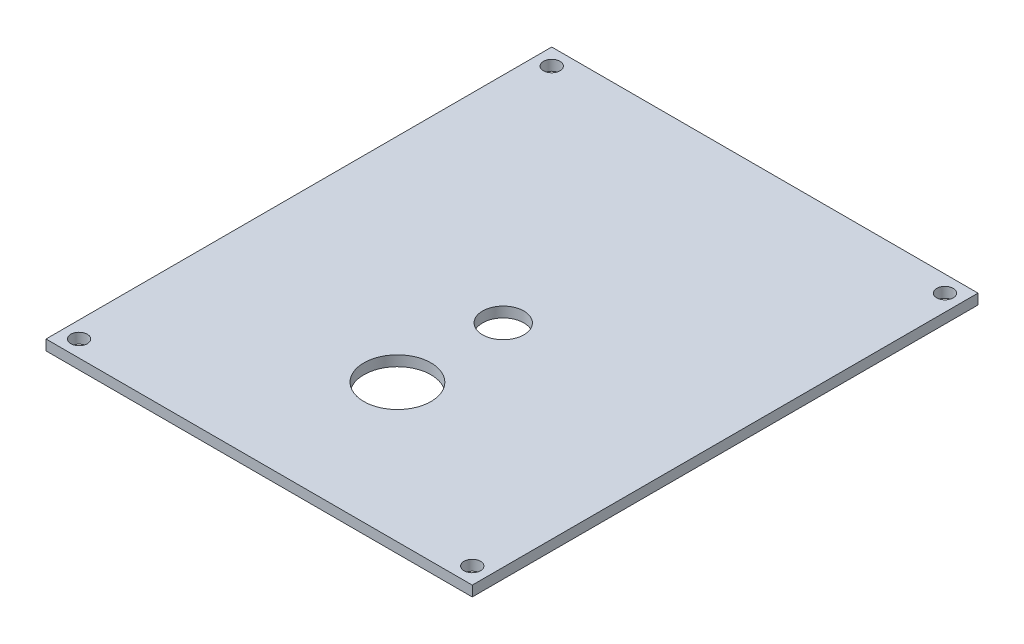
from build123d import *

# Parameters (mm, degrees)
SKETCH1_W                  = 82.6
SKETCH1_H                  = 98
BOSS_EXTRUDE1_DEPTH        = 2
F_3_2_3_2_DIAMETER_HOLE1_D = 3.2
SKETCH4_R                  = 6.5
CUT_EXTRUDE1_DEPTH         = 2
SKETCH5_R                  = 4
CUT_EXTRUDE2_DEPTH         = 10


with BuildPart() as part:
    # Sketch1 → Boss-Extrude1 (new body)
    with BuildSketch(Plane(origin=(0, 0, 0), x_dir=(1, 0, 0), z_dir=(0, 1, 0))):
        Rectangle(SKETCH1_W, SKETCH1_H)
    extrude(amount=BOSS_EXTRUDE1_DEPTH)

    # 3.2 _3.2_ Diameter Hole1 (through all)
    with Locations(Plane(origin=(0, 2, 0), x_dir=(1, 0, 0), z_dir=(0, 1, 0))):
        with Locations((-38.1, 45.8), (38.1, 45.8), (38.1, -45.8), (-38.1, -45.8)):
            Hole(F_3_2_3_2_DIAMETER_HOLE1_D / 2)

    # Sketch4 → Cut-Extrude1 (cut)
    with BuildSketch(Plane(origin=(0, 2, 0), x_dir=(1, 0, 0), z_dir=(0, 1, 0))):
        with Locations(Location((0, -22.2, 0), (0, 0, 270))):
            Circle(SKETCH4_R)
    extrude(amount=-CUT_EXTRUDE1_DEPTH, mode=Mode.SUBTRACT)

    # Sketch5 → Cut-Extrude2 (cut)
    with BuildSketch(Plane(origin=(0, 2, 0), x_dir=(1, 0, 0), z_dir=(0, 1, 0))):
        with Locations(Location((0.3, -2, 0), (0, 0, 270))):
            Circle(SKETCH5_R)
    extrude(amount=-CUT_EXTRUDE2_DEPTH, mode=Mode.SUBTRACT)


solid = part.part
